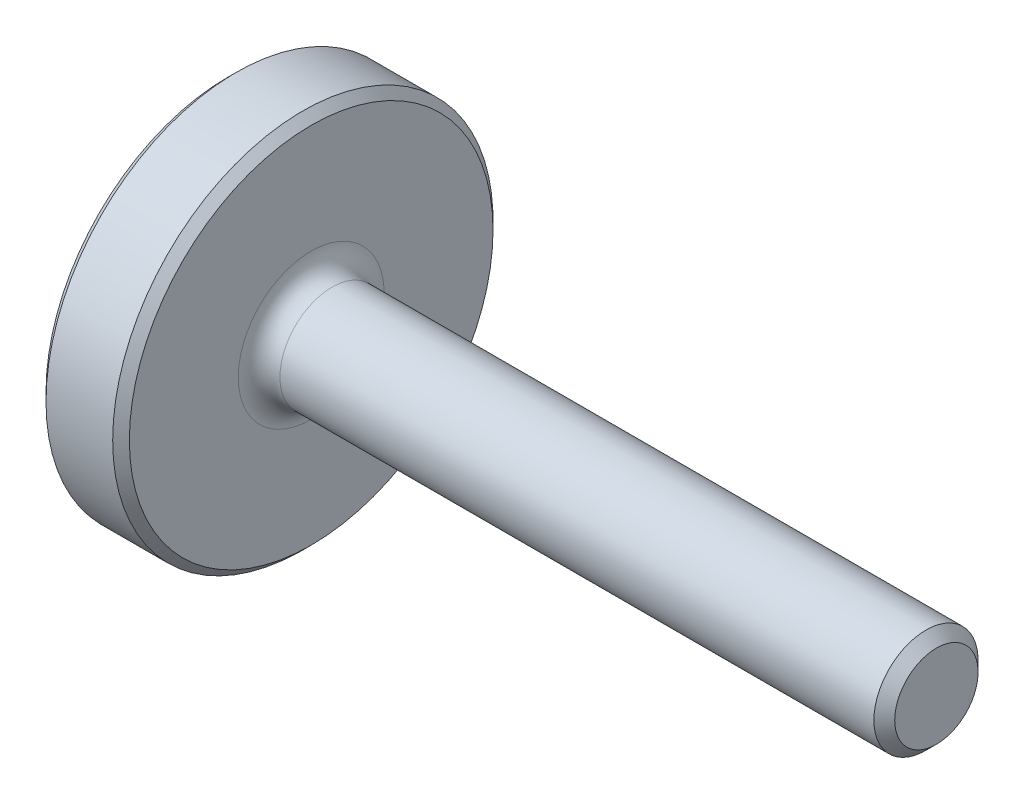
ISO-10303-21;
HEADER;
FILE_DESCRIPTION(('STEP AP214'),'2;1');
FILE_NAME('part.step','',(''),(''),'','','');
FILE_SCHEMA(('AUTOMOTIVE_DESIGN { 1 0 10303 214 1 1 1 1 }'));
ENDSEC;
DATA;
#1=APPLICATION_CONTEXT('core data for automotive mechanical design processes');
#2=APPLICATION_PROTOCOL_DEFINITION('international standard','automotive_design',2000,#1);
#3=PRODUCT_CONTEXT('',#1,'mechanical');
#4=PRODUCT('Part','Part','',(#3));
#5=PRODUCT_RELATED_PRODUCT_CATEGORY('part','',(#4));
#6=PRODUCT_DEFINITION_FORMATION('','',#4);
#7=PRODUCT_DEFINITION_CONTEXT('part definition',#1,'design');
#8=PRODUCT_DEFINITION('design','',#6,#7);
#9=PRODUCT_DEFINITION_SHAPE('','',#8);
#10=(LENGTH_UNIT() NAMED_UNIT(*) SI_UNIT(.MILLI.,.METRE.));
#11=(NAMED_UNIT(*) PLANE_ANGLE_UNIT() SI_UNIT($,.RADIAN.));
#12=(NAMED_UNIT(*) SI_UNIT($,.STERADIAN.) SOLID_ANGLE_UNIT());
#13=UNCERTAINTY_MEASURE_WITH_UNIT(LENGTH_MEASURE(1.E-05),#10,'distance_accuracy_value','');
#14=(GEOMETRIC_REPRESENTATION_CONTEXT(3) GLOBAL_UNCERTAINTY_ASSIGNED_CONTEXT((#13)) GLOBAL_UNIT_ASSIGNED_CONTEXT((#10,
#11,#12)) REPRESENTATION_CONTEXT('',''));
#15=CARTESIAN_POINT('',(0.,0.,0.));
#16=DIRECTION('',(0.,0.,1.));
#17=DIRECTION('',(1.,0.,0.));
#18=AXIS2_PLACEMENT_3D('',#15,#16,#17);
#19=CARTESIAN_POINT('',(68.,4.00000000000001,0.));
#20=DIRECTION('',(1.,0.,0.));
#21=DIRECTION('',(0.,0.,-1.));
#22=AXIS2_PLACEMENT_3D('',#19,#20,#21);
#23=PLANE('',#22);
#24=CARTESIAN_POINT('',(68.,0.,0.));
#25=DIRECTION('',(-1.,0.,0.));
#26=DIRECTION('',(0.,0.,1.));
#27=AXIS2_PLACEMENT_3D('',#24,#25,#26);
#28=CIRCLE('',#27,4.00000000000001);
#29=CARTESIAN_POINT('',(68.,0.,4.00000000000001));
#30=VERTEX_POINT('',#29);
#31=EDGE_CURVE('E48',#30,#30,#28,.T.);
#32=ORIENTED_EDGE('',*,*,#31,.F.);
#33=EDGE_LOOP('',(#32));
#34=FACE_BOUND('',#33,.T.);
#35=ADVANCED_FACE('F37',(#34),#23,.T.);
#36=CARTESIAN_POINT('',(67.,0.,0.));
#37=DIRECTION('',(-1.,0.,0.));
#38=DIRECTION('',(0.,0.,1.));
#39=AXIS2_PLACEMENT_3D('',#36,#37,#38);
#40=CONICAL_SURFACE('',#39,5.,0.785398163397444);
#41=ORIENTED_EDGE('',*,*,#31,.T.);
#42=EDGE_LOOP('',(#41));
#43=FACE_BOUND('',#42,.T.);
#44=CARTESIAN_POINT('',(67.,0.,0.));
#45=DIRECTION('',(-1.,0.,0.));
#46=DIRECTION('',(0.,0.,1.));
#47=AXIS2_PLACEMENT_3D('',#44,#45,#46);
#48=CIRCLE('',#47,5.);
#49=CARTESIAN_POINT('',(67.,0.,5.));
#50=VERTEX_POINT('',#49);
#51=EDGE_CURVE('E52',#50,#50,#48,.T.);
#52=ORIENTED_EDGE('',*,*,#51,.F.);
#53=EDGE_LOOP('',(#52));
#54=FACE_BOUND('',#53,.T.);
#55=ADVANCED_FACE('F90',(#43,#54),#40,.T.);
#56=CARTESIAN_POINT('',(-11.4007888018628,0.,0.));
#57=DIRECTION('',(-1.,0.,0.));
#58=DIRECTION('',(0.,0.,1.));
#59=AXIS2_PLACEMENT_3D('',#56,#57,#58);
#60=CYLINDRICAL_SURFACE('',#59,5.);
#61=CARTESIAN_POINT('',(10.,0.,0.));
#62=DIRECTION('',(-1.,0.,0.));
#63=DIRECTION('',(0.,0.,1.));
#64=AXIS2_PLACEMENT_3D('',#61,#62,#63);
#65=CIRCLE('',#64,5.);
#66=CARTESIAN_POINT('',(10.,0.,5.));
#67=VERTEX_POINT('',#66);
#68=EDGE_CURVE('E10',#67,#67,#65,.F.);
#69=ORIENTED_EDGE('',*,*,#68,.T.);
#70=EDGE_LOOP('',(#69));
#71=FACE_BOUND('',#70,.T.);
#72=ORIENTED_EDGE('',*,*,#51,.T.);
#73=EDGE_LOOP('',(#72));
#74=FACE_BOUND('',#73,.T.);
#75=ADVANCED_FACE('F96',(#71,#74),#60,.T.);
#76=CARTESIAN_POINT('',(8.,5.,0.));
#77=DIRECTION('',(-1.,0.,0.));
#78=DIRECTION('',(0.,0.,1.));
#79=AXIS2_PLACEMENT_3D('',#76,#77,#78);
#80=PLANE('',#79);
#81=CARTESIAN_POINT('',(8.,0.,0.));
#82=DIRECTION('',(-1.,0.,0.));
#83=DIRECTION('',(0.,0.,1.));
#84=AXIS2_PLACEMENT_3D('',#81,#82,#83);
#85=CIRCLE('',#84,7.);
#86=CARTESIAN_POINT('',(8.,0.,7.));
#87=VERTEX_POINT('',#86);
#88=EDGE_CURVE('E44',#87,#87,#85,.T.);
#89=ORIENTED_EDGE('',*,*,#88,.T.);
#90=EDGE_LOOP('',(#89));
#91=FACE_BOUND('',#90,.T.);
#92=CARTESIAN_POINT('',(8.,0.,0.));
#93=DIRECTION('',(-1.,0.,0.));
#94=DIRECTION('',(0.,0.,1.));
#95=AXIS2_PLACEMENT_3D('',#92,#93,#94);
#96=CIRCLE('',#95,17.45);
#97=CARTESIAN_POINT('',(8.,0.,17.45));
#98=VERTEX_POINT('',#97);
#99=EDGE_CURVE('E57',#98,#98,#96,.T.);
#100=ORIENTED_EDGE('',*,*,#99,.F.);
#101=EDGE_LOOP('',(#100));
#102=FACE_BOUND('',#101,.T.);
#103=ADVANCED_FACE('F86',(#91,#102),#80,.F.);
#104=CARTESIAN_POINT('',(7.2,0.,0.));
#105=DIRECTION('',(-1.,0.,0.));
#106=DIRECTION('',(0.,0.,1.));
#107=AXIS2_PLACEMENT_3D('',#104,#105,#106);
#108=CONICAL_SURFACE('',#107,18.25,0.785398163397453);
#109=ORIENTED_EDGE('',*,*,#99,.T.);
#110=EDGE_LOOP('',(#109));
#111=FACE_BOUND('',#110,.T.);
#112=CARTESIAN_POINT('',(7.2,0.,0.));
#113=DIRECTION('',(-1.,0.,0.));
#114=DIRECTION('',(0.,0.,1.));
#115=AXIS2_PLACEMENT_3D('',#112,#113,#114);
#116=CIRCLE('',#115,18.25);
#117=CARTESIAN_POINT('',(7.2,0.,18.25));
#118=VERTEX_POINT('',#117);
#119=EDGE_CURVE('E60',#118,#118,#116,.T.);
#120=ORIENTED_EDGE('',*,*,#119,.F.);
#121=EDGE_LOOP('',(#120));
#122=FACE_BOUND('',#121,.T.);
#123=ADVANCED_FACE('F80',(#111,#122),#108,.T.);
#124=CARTESIAN_POINT('',(-11.4007888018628,0.,0.));
#125=DIRECTION('',(-1.,0.,0.));
#126=DIRECTION('',(0.,0.,1.));
#127=AXIS2_PLACEMENT_3D('',#124,#125,#126);
#128=CYLINDRICAL_SURFACE('',#127,18.25);
#129=ORIENTED_EDGE('',*,*,#119,.T.);
#130=EDGE_LOOP('',(#129));
#131=FACE_BOUND('',#130,.T.);
#132=CARTESIAN_POINT('',(0.8,0.,0.));
#133=DIRECTION('',(-1.,0.,0.));
#134=DIRECTION('',(0.,0.,1.));
#135=AXIS2_PLACEMENT_3D('',#132,#133,#134);
#136=CIRCLE('',#135,18.25);
#137=CARTESIAN_POINT('',(0.8,0.,18.25));
#138=VERTEX_POINT('',#137);
#139=EDGE_CURVE('E63',#138,#138,#136,.T.);
#140=ORIENTED_EDGE('',*,*,#139,.F.);
#141=EDGE_LOOP('',(#140));
#142=FACE_BOUND('',#141,.T.);
#143=ADVANCED_FACE('F75',(#131,#142),#128,.T.);
#144=CARTESIAN_POINT('',(0.8,0.,0.));
#145=DIRECTION('',(1.,0.,0.));
#146=DIRECTION('',(0.,0.,-1.));
#147=AXIS2_PLACEMENT_3D('',#144,#145,#146);
#148=CONICAL_SURFACE('',#147,18.25,0.785398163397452);
#149=CARTESIAN_POINT('',(0.,0.,0.));
#150=DIRECTION('',(-1.,0.,0.));
#151=DIRECTION('',(0.,0.,1.));
#152=AXIS2_PLACEMENT_3D('',#149,#150,#151);
#153=CIRCLE('',#152,17.45);
#154=CARTESIAN_POINT('',(0.,0.,17.45));
#155=VERTEX_POINT('',#154);
#156=EDGE_CURVE('E66',#155,#155,#153,.T.);
#157=ORIENTED_EDGE('',*,*,#156,.F.);
#158=EDGE_LOOP('',(#157));
#159=FACE_BOUND('',#158,.T.);
#160=ORIENTED_EDGE('',*,*,#139,.T.);
#161=EDGE_LOOP('',(#160));
#162=FACE_BOUND('',#161,.T.);
#163=ADVANCED_FACE('F72',(#159,#162),#148,.T.);
#164=CARTESIAN_POINT('',(0.,0.,0.));
#165=DIRECTION('',(-1.,0.,0.));
#166=DIRECTION('',(0.,0.,1.));
#167=AXIS2_PLACEMENT_3D('',#164,#165,#166);
#168=PLANE('',#167);
#169=ORIENTED_EDGE('',*,*,#156,.T.);
#170=EDGE_LOOP('',(#169));
#171=FACE_BOUND('',#170,.T.);
#172=ADVANCED_FACE('F70',(#171),#168,.T.);
#173=CARTESIAN_POINT('',(10.,0.,0.));
#174=DIRECTION('',(-1.,0.,0.));
#175=DIRECTION('',(0.,0.,1.));
#176=AXIS2_PLACEMENT_3D('',#173,#174,#175);
#177=TOROIDAL_SURFACE('',#176,7.,2.);
#178=ORIENTED_EDGE('',*,*,#68,.F.);
#179=EDGE_LOOP('',(#178));
#180=FACE_BOUND('',#179,.T.);
#181=ORIENTED_EDGE('',*,*,#88,.F.);
#182=EDGE_LOOP('',(#181));
#183=FACE_BOUND('',#182,.T.);
#184=ADVANCED_FACE('F39',(#180,#183),#177,.F.);
#185=CLOSED_SHELL('',(#35,#55,#75,#103,#123,#143,#163,#172,#184));
#186=MANIFOLD_SOLID_BREP('B2',#185);
#187=ADVANCED_BREP_SHAPE_REPRESENTATION('',(#18,#186),#14);
#188=SHAPE_DEFINITION_REPRESENTATION(#9,#187);
ENDSEC;
END-ISO-10303-21;
